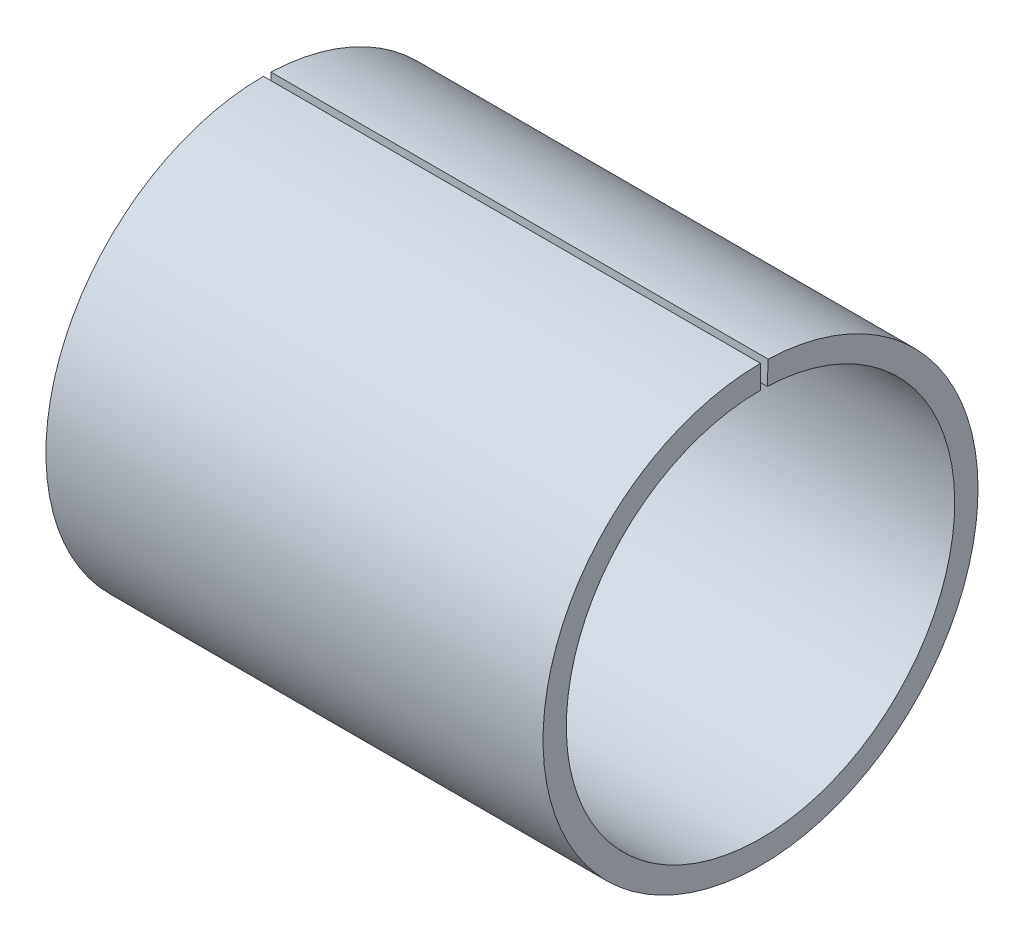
ISO-10303-21;
HEADER;
FILE_DESCRIPTION(('STEP AP214'),'2;1');
FILE_NAME('part.step','',(''),(''),'','','');
FILE_SCHEMA(('AUTOMOTIVE_DESIGN { 1 0 10303 214 1 1 1 1 }'));
ENDSEC;
DATA;
#1=APPLICATION_CONTEXT('core data for automotive mechanical design processes');
#2=APPLICATION_PROTOCOL_DEFINITION('international standard','automotive_design',2000,#1);
#3=PRODUCT_CONTEXT('',#1,'mechanical');
#4=PRODUCT('Part','Part','',(#3));
#5=PRODUCT_RELATED_PRODUCT_CATEGORY('part','',(#4));
#6=PRODUCT_DEFINITION_FORMATION('','',#4);
#7=PRODUCT_DEFINITION_CONTEXT('part definition',#1,'design');
#8=PRODUCT_DEFINITION('design','',#6,#7);
#9=PRODUCT_DEFINITION_SHAPE('','',#8);
#10=(LENGTH_UNIT() NAMED_UNIT(*) SI_UNIT(.MILLI.,.METRE.));
#11=(NAMED_UNIT(*) PLANE_ANGLE_UNIT() SI_UNIT($,.RADIAN.));
#12=(NAMED_UNIT(*) SI_UNIT($,.STERADIAN.) SOLID_ANGLE_UNIT());
#13=UNCERTAINTY_MEASURE_WITH_UNIT(LENGTH_MEASURE(1.E-05),#10,'distance_accuracy_value','');
#14=(GEOMETRIC_REPRESENTATION_CONTEXT(3) GLOBAL_UNCERTAINTY_ASSIGNED_CONTEXT((#13)) GLOBAL_UNIT_ASSIGNED_CONTEXT((#10,
#11,#12)) REPRESENTATION_CONTEXT('',''));
#15=CARTESIAN_POINT('',(0.,0.,0.));
#16=DIRECTION('',(0.,0.,1.));
#17=DIRECTION('',(1.,0.,0.));
#18=AXIS2_PLACEMENT_3D('',#15,#16,#17);
#19=CARTESIAN_POINT('',(0.,13.9914715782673,-0.488592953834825));
#20=DIRECTION('',(1.,0.,0.));
#21=DIRECTION('',(0.,0.,-1.));
#22=AXIS2_PLACEMENT_3D('',#19,#20,#21);
#23=PLANE('',#22);
#24=CARTESIAN_POINT('',(0.,0.,0.));
#25=DIRECTION('',(-1.,0.,0.));
#26=DIRECTION('',(0.,0.,1.));
#27=AXIS2_PLACEMENT_3D('',#24,#25,#26);
#28=CIRCLE('',#27,12.5);
#29=CARTESIAN_POINT('',(0.,12.4923853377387,-0.436243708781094));
#30=VERTEX_POINT('',#29);
#31=CARTESIAN_POINT('',(0.,12.5,0.));
#32=VERTEX_POINT('',#31);
#33=EDGE_CURVE('E11',#30,#32,#28,.T.);
#34=ORIENTED_EDGE('',*,*,#33,.F.);
#35=DIRECTION('',(0.,-0.999390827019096,0.0348994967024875));
#36=VECTOR('',#35,1.);
#37=CARTESIAN_POINT('',(0.,13.9914715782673,-0.488592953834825));
#38=LINE('',#37,#36);
#39=CARTESIAN_POINT('',(0.,13.9914715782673,-0.488592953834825));
#40=VERTEX_POINT('',#39);
#41=EDGE_CURVE('E88',#40,#30,#38,.T.);
#42=ORIENTED_EDGE('',*,*,#41,.F.);
#43=CARTESIAN_POINT('',(0.,0.,0.));
#44=DIRECTION('',(-1.,0.,0.));
#45=DIRECTION('',(0.,0.,1.));
#46=AXIS2_PLACEMENT_3D('',#43,#44,#45);
#47=CIRCLE('',#46,14.);
#48=CARTESIAN_POINT('',(0.,14.,0.));
#49=VERTEX_POINT('',#48);
#50=EDGE_CURVE('E41',#40,#49,#47,.T.);
#51=ORIENTED_EDGE('',*,*,#50,.T.);
#52=DIRECTION('',(0.,-1.,0.));
#53=VECTOR('',#52,1.);
#54=CARTESIAN_POINT('',(0.,14.,0.));
#55=LINE('',#54,#53);
#56=EDGE_CURVE('E77',#49,#32,#55,.T.);
#57=ORIENTED_EDGE('',*,*,#56,.T.);
#58=EDGE_LOOP('',(#34,#42,#51,#57));
#59=FACE_BOUND('',#58,.T.);
#60=ADVANCED_FACE('F26',(#59),#23,.F.);
#61=CARTESIAN_POINT('',(0.,0.,0.));
#62=DIRECTION('',(-1.,0.,0.));
#63=DIRECTION('',(0.,0.,1.));
#64=AXIS2_PLACEMENT_3D('',#61,#62,#63);
#65=CYLINDRICAL_SURFACE('',#64,12.5);
#66=CARTESIAN_POINT('',(32.,0.,0.));
#67=DIRECTION('',(-1.,0.,0.));
#68=DIRECTION('',(0.,0.,1.));
#69=AXIS2_PLACEMENT_3D('',#66,#67,#68);
#70=CIRCLE('',#69,12.5);
#71=CARTESIAN_POINT('',(32.,12.4923853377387,-0.436243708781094));
#72=VERTEX_POINT('',#71);
#73=CARTESIAN_POINT('',(32.,12.5,0.));
#74=VERTEX_POINT('',#73);
#75=EDGE_CURVE('E34',#72,#74,#70,.T.);
#76=ORIENTED_EDGE('',*,*,#75,.F.);
#77=DIRECTION('',(1.,0.,0.));
#78=VECTOR('',#77,1.);
#79=CARTESIAN_POINT('',(0.,12.4923853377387,-0.436243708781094));
#80=LINE('',#79,#78);
#81=EDGE_CURVE('E73',#30,#72,#80,.T.);
#82=ORIENTED_EDGE('',*,*,#81,.F.);
#83=ORIENTED_EDGE('',*,*,#33,.T.);
#84=DIRECTION('',(1.,0.,0.));
#85=VECTOR('',#84,1.);
#86=CARTESIAN_POINT('',(0.,12.5,0.));
#87=LINE('',#86,#85);
#88=EDGE_CURVE('E70',#32,#74,#87,.T.);
#89=ORIENTED_EDGE('',*,*,#88,.T.);
#90=EDGE_LOOP('',(#76,#82,#83,#89));
#91=FACE_BOUND('',#90,.T.);
#92=ADVANCED_FACE('F28',(#91),#65,.F.);
#93=CARTESIAN_POINT('',(32.,13.9914715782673,-0.488592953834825));
#94=DIRECTION('',(-1.,0.,0.));
#95=DIRECTION('',(0.,0.,1.));
#96=AXIS2_PLACEMENT_3D('',#93,#94,#95);
#97=PLANE('',#96);
#98=CARTESIAN_POINT('',(32.,0.,0.));
#99=DIRECTION('',(-1.,0.,0.));
#100=DIRECTION('',(0.,0.,1.));
#101=AXIS2_PLACEMENT_3D('',#98,#99,#100);
#102=CIRCLE('',#101,14.);
#103=CARTESIAN_POINT('',(32.,13.9914715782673,-0.488592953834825));
#104=VERTEX_POINT('',#103);
#105=CARTESIAN_POINT('',(32.,14.,0.));
#106=VERTEX_POINT('',#105);
#107=EDGE_CURVE('E49',#104,#106,#102,.T.);
#108=ORIENTED_EDGE('',*,*,#107,.F.);
#109=DIRECTION('',(0.,0.999390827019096,-0.0348994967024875));
#110=VECTOR('',#109,1.);
#111=CARTESIAN_POINT('',(32.,13.9914715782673,-0.488592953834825));
#112=LINE('',#111,#110);
#113=EDGE_CURVE('E91',#72,#104,#112,.T.);
#114=ORIENTED_EDGE('',*,*,#113,.F.);
#115=ORIENTED_EDGE('',*,*,#75,.T.);
#116=DIRECTION('',(0.,1.,0.));
#117=VECTOR('',#116,1.);
#118=CARTESIAN_POINT('',(32.,14.,0.));
#119=LINE('',#118,#117);
#120=EDGE_CURVE('E82',#74,#106,#119,.T.);
#121=ORIENTED_EDGE('',*,*,#120,.T.);
#122=EDGE_LOOP('',(#108,#114,#115,#121));
#123=FACE_BOUND('',#122,.T.);
#124=ADVANCED_FACE('F97',(#123),#97,.F.);
#125=CARTESIAN_POINT('',(0.,0.,0.));
#126=DIRECTION('',(-1.,0.,0.));
#127=DIRECTION('',(0.,0.,1.));
#128=AXIS2_PLACEMENT_3D('',#125,#126,#127);
#129=CYLINDRICAL_SURFACE('',#128,14.);
#130=DIRECTION('',(-1.,0.,0.));
#131=VECTOR('',#130,1.);
#132=CARTESIAN_POINT('',(0.,13.9914715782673,-0.488592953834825));
#133=LINE('',#132,#131);
#134=EDGE_CURVE('E93',#104,#40,#133,.T.);
#135=ORIENTED_EDGE('',*,*,#134,.F.);
#136=ORIENTED_EDGE('',*,*,#107,.T.);
#137=DIRECTION('',(-1.,0.,0.));
#138=VECTOR('',#137,1.);
#139=CARTESIAN_POINT('',(0.,14.,0.));
#140=LINE('',#139,#138);
#141=EDGE_CURVE('E84',#106,#49,#140,.T.);
#142=ORIENTED_EDGE('',*,*,#141,.T.);
#143=ORIENTED_EDGE('',*,*,#50,.F.);
#144=EDGE_LOOP('',(#135,#136,#142,#143));
#145=FACE_BOUND('',#144,.T.);
#146=ADVANCED_FACE('F100',(#145),#129,.T.);
#147=CARTESIAN_POINT('',(0.,12.4923853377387,-0.436243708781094));
#148=DIRECTION('',(0.,0.0348994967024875,0.999390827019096));
#149=DIRECTION('',(1.,0.,0.));
#150=AXIS2_PLACEMENT_3D('',#147,#148,#149);
#151=PLANE('',#150);
#152=ORIENTED_EDGE('',*,*,#41,.T.);
#153=ORIENTED_EDGE('',*,*,#81,.T.);
#154=ORIENTED_EDGE('',*,*,#113,.T.);
#155=ORIENTED_EDGE('',*,*,#134,.T.);
#156=EDGE_LOOP('',(#152,#153,#154,#155));
#157=FACE_BOUND('',#156,.T.);
#158=ADVANCED_FACE('F99',(#157),#151,.T.);
#159=CARTESIAN_POINT('',(0.,12.5,0.));
#160=DIRECTION('',(0.,0.,1.));
#161=DIRECTION('',(1.,0.,0.));
#162=AXIS2_PLACEMENT_3D('',#159,#160,#161);
#163=PLANE('',#162);
#164=ORIENTED_EDGE('',*,*,#56,.F.);
#165=ORIENTED_EDGE('',*,*,#141,.F.);
#166=ORIENTED_EDGE('',*,*,#120,.F.);
#167=ORIENTED_EDGE('',*,*,#88,.F.);
#168=EDGE_LOOP('',(#164,#165,#166,#167));
#169=FACE_BOUND('',#168,.T.);
#170=ADVANCED_FACE('F81',(#169),#163,.F.);
#171=CLOSED_SHELL('',(#60,#92,#124,#146,#158,#170));
#172=MANIFOLD_SOLID_BREP('B2',#171);
#173=ADVANCED_BREP_SHAPE_REPRESENTATION('',(#18,#172),#14);
#174=SHAPE_DEFINITION_REPRESENTATION(#9,#173);
ENDSEC;
END-ISO-10303-21;
